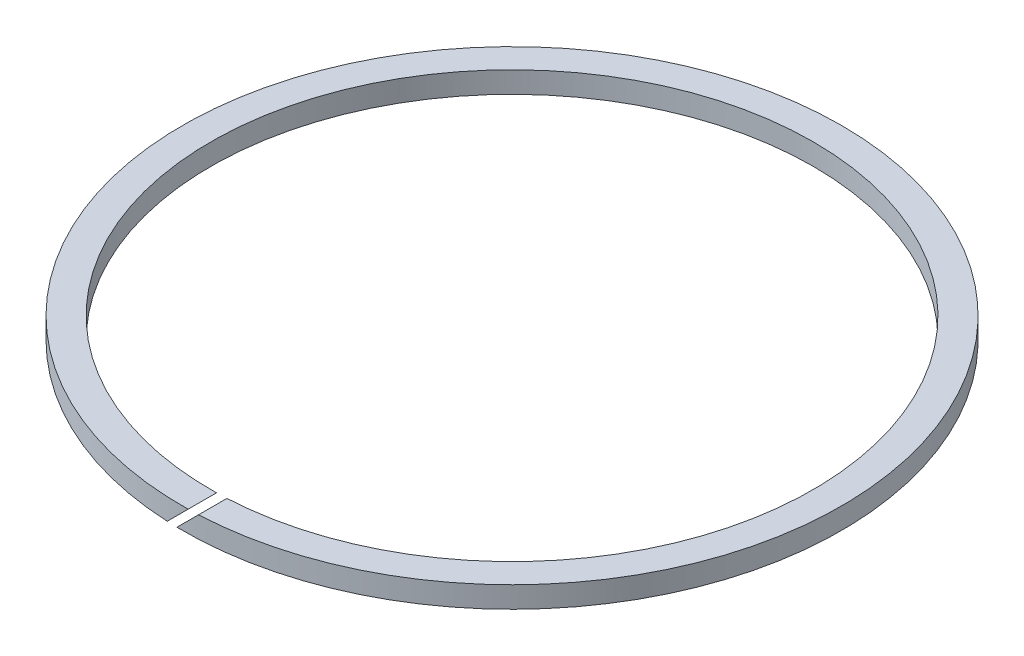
from build123d import *

# Parameters (mm, degrees)
SKETCH1_R                    = 46.5
SKETCH1_R_2                  = 42.5
BOSS_EXTRUDE1_DEPTH          = 1.5
CUT_EXTRUDE_THIN1_DEPTH      = 66.778035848
CUT_EXTRUDE_THIN1_DEPTH_BACK = 3


with BuildPart() as part:
    # Sketch1 → Boss-Extrude1 (new, symmetric)
    with BuildSketch(Plane(origin=(0, 0, 0), x_dir=(1, 0, 0), z_dir=(0, 1, 0))):
        with Locations(Location((0, 0, 0), (0, 0, 270))):
            Circle(SKETCH1_R)
        with Locations(Location((0, 0, 0), (0, 0, 270))):
            Circle(SKETCH1_R_2, mode=Mode.SUBTRACT)
    extrude(amount=BOSS_EXTRUDE1_DEPTH, both=True)

    # Sketch4 → Cut-Extrude-Thin1 (cut, two sides: drawn at the far end of the back side and taken through both)
    with BuildSketch(Plane.XY.offset(-CUT_EXTRUDE_THIN1_DEPTH_BACK)):
        Polygon((8.242068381, 8.949175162), (-8.949175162, -8.242068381), (-8.242068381, -8.949175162), (8.949175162, 8.242068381), align=None)
    extrude(amount=CUT_EXTRUDE_THIN1_DEPTH + CUT_EXTRUDE_THIN1_DEPTH_BACK, mode=Mode.SUBTRACT)


solid = part.part
